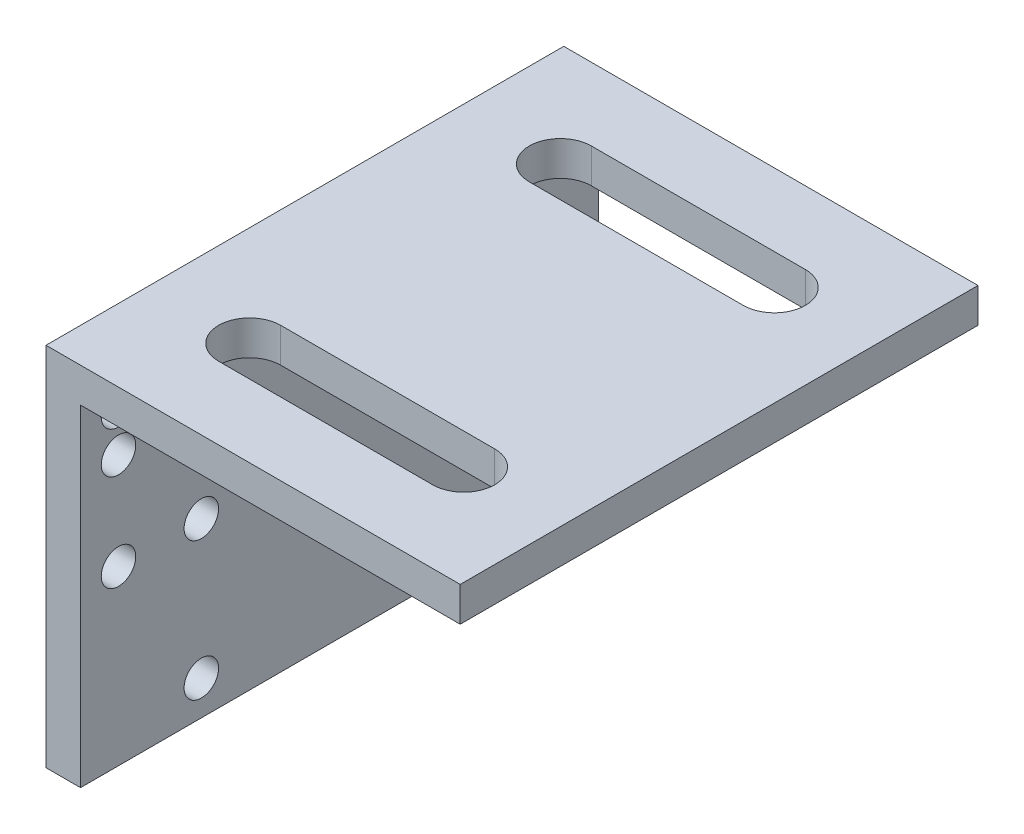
ISO-10303-21;
HEADER;
FILE_DESCRIPTION(('STEP AP214'),'2;1');
FILE_NAME('part.step','',(''),(''),'','','');
FILE_SCHEMA(('AUTOMOTIVE_DESIGN { 1 0 10303 214 1 1 1 1 }'));
ENDSEC;
DATA;
#1=APPLICATION_CONTEXT('core data for automotive mechanical design processes');
#2=APPLICATION_PROTOCOL_DEFINITION('international standard','automotive_design',2000,#1);
#3=PRODUCT_CONTEXT('',#1,'mechanical');
#4=PRODUCT('Part','Part','',(#3));
#5=PRODUCT_RELATED_PRODUCT_CATEGORY('part','',(#4));
#6=PRODUCT_DEFINITION_FORMATION('','',#4);
#7=PRODUCT_DEFINITION_CONTEXT('part definition',#1,'design');
#8=PRODUCT_DEFINITION('design','',#6,#7);
#9=PRODUCT_DEFINITION_SHAPE('','',#8);
#10=(LENGTH_UNIT() NAMED_UNIT(*) SI_UNIT(.MILLI.,.METRE.));
#11=(NAMED_UNIT(*) PLANE_ANGLE_UNIT() SI_UNIT($,.RADIAN.));
#12=(NAMED_UNIT(*) SI_UNIT($,.STERADIAN.) SOLID_ANGLE_UNIT());
#13=UNCERTAINTY_MEASURE_WITH_UNIT(LENGTH_MEASURE(1.E-05),#10,'distance_accuracy_value','');
#14=(GEOMETRIC_REPRESENTATION_CONTEXT(3) GLOBAL_UNCERTAINTY_ASSIGNED_CONTEXT((#13)) GLOBAL_UNIT_ASSIGNED_CONTEXT((#10,
#11,#12)) REPRESENTATION_CONTEXT('',''));
#15=CARTESIAN_POINT('',(0.,0.,0.));
#16=DIRECTION('',(0.,0.,1.));
#17=DIRECTION('',(1.,0.,0.));
#18=AXIS2_PLACEMENT_3D('',#15,#16,#17);
#19=CARTESIAN_POINT('',(4.99999999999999,-5.,0.));
#20=DIRECTION('',(1.,0.,0.));
#21=DIRECTION('',(0.,0.,-1.));
#22=AXIS2_PLACEMENT_3D('',#19,#20,#21);
#23=PLANE('',#22);
#24=CARTESIAN_POINT('',(4.99999999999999,-48.,-20.));
#25=DIRECTION('',(1.,0.,0.));
#26=DIRECTION('',(0.,1.,0.));
#27=AXIS2_PLACEMENT_3D('',#24,#25,#26);
#28=CIRCLE('',#27,2.5);
#29=CARTESIAN_POINT('',(4.99999999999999,-45.5,-20.));
#30=VERTEX_POINT('',#29);
#31=EDGE_CURVE('E138',#30,#30,#28,.F.);
#32=ORIENTED_EDGE('',*,*,#31,.T.);
#33=EDGE_LOOP('',(#32));
#34=FACE_BOUND('',#33,.T.);
#35=CARTESIAN_POINT('',(4.99999999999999,-28.,-20.));
#36=DIRECTION('',(1.,0.,0.));
#37=DIRECTION('',(0.,1.,0.));
#38=AXIS2_PLACEMENT_3D('',#35,#36,#37);
#39=CIRCLE('',#38,2.5);
#40=CARTESIAN_POINT('',(4.99999999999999,-25.5,-20.));
#41=VERTEX_POINT('',#40);
#42=EDGE_CURVE('E213',#41,#41,#39,.F.);
#43=ORIENTED_EDGE('',*,*,#42,.T.);
#44=EDGE_LOOP('',(#43));
#45=FACE_BOUND('',#44,.T.);
#46=CARTESIAN_POINT('',(4.99999999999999,-8.00000000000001,-20.));
#47=DIRECTION('',(1.,0.,0.));
#48=DIRECTION('',(0.,1.,0.));
#49=AXIS2_PLACEMENT_3D('',#46,#47,#48);
#50=CIRCLE('',#49,2.5);
#51=CARTESIAN_POINT('',(4.99999999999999,-5.50000000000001,-20.));
#52=VERTEX_POINT('',#51);
#53=EDGE_CURVE('E216',#52,#52,#50,.F.);
#54=ORIENTED_EDGE('',*,*,#53,.T.);
#55=EDGE_LOOP('',(#54));
#56=FACE_BOUND('',#55,.T.);
#57=CARTESIAN_POINT('',(4.99999999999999,-8.00000000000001,20.));
#58=DIRECTION('',(1.,0.,0.));
#59=DIRECTION('',(0.,1.,0.));
#60=AXIS2_PLACEMENT_3D('',#57,#58,#59);
#61=CIRCLE('',#60,2.5);
#62=CARTESIAN_POINT('',(4.99999999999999,-5.50000000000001,20.));
#63=VERTEX_POINT('',#62);
#64=EDGE_CURVE('E219',#63,#63,#61,.F.);
#65=ORIENTED_EDGE('',*,*,#64,.T.);
#66=EDGE_LOOP('',(#65));
#67=FACE_BOUND('',#66,.T.);
#68=CARTESIAN_POINT('',(4.99999999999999,-28.,20.));
#69=DIRECTION('',(1.,0.,0.));
#70=DIRECTION('',(0.,1.,0.));
#71=AXIS2_PLACEMENT_3D('',#68,#69,#70);
#72=CIRCLE('',#71,2.5);
#73=CARTESIAN_POINT('',(4.99999999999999,-25.5,20.));
#74=VERTEX_POINT('',#73);
#75=EDGE_CURVE('E222',#74,#74,#72,.F.);
#76=ORIENTED_EDGE('',*,*,#75,.T.);
#77=EDGE_LOOP('',(#76));
#78=FACE_BOUND('',#77,.T.);
#79=CARTESIAN_POINT('',(4.99999999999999,-48.,20.));
#80=DIRECTION('',(1.,0.,0.));
#81=DIRECTION('',(0.,1.,0.));
#82=AXIS2_PLACEMENT_3D('',#79,#80,#81);
#83=CIRCLE('',#82,2.5);
#84=CARTESIAN_POINT('',(4.99999999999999,-45.5,20.));
#85=VERTEX_POINT('',#84);
#86=EDGE_CURVE('E225',#85,#85,#83,.F.);
#87=ORIENTED_EDGE('',*,*,#86,.T.);
#88=EDGE_LOOP('',(#87));
#89=FACE_BOUND('',#88,.T.);
#90=CARTESIAN_POINT('',(4.99999999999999,-8.00000000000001,32.));
#91=DIRECTION('',(1.,0.,0.));
#92=DIRECTION('',(0.,1.,0.));
#93=AXIS2_PLACEMENT_3D('',#90,#91,#92);
#94=CIRCLE('',#93,2.5);
#95=CARTESIAN_POINT('',(4.99999999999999,-5.50000000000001,32.));
#96=VERTEX_POINT('',#95);
#97=EDGE_CURVE('E228',#96,#96,#94,.F.);
#98=ORIENTED_EDGE('',*,*,#97,.T.);
#99=EDGE_LOOP('',(#98));
#100=FACE_BOUND('',#99,.T.);
#101=CARTESIAN_POINT('',(4.99999999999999,-14.,32.));
#102=DIRECTION('',(1.,0.,0.));
#103=DIRECTION('',(0.,1.,0.));
#104=AXIS2_PLACEMENT_3D('',#101,#102,#103);
#105=CIRCLE('',#104,2.5);
#106=CARTESIAN_POINT('',(4.99999999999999,-11.5,32.));
#107=VERTEX_POINT('',#106);
#108=EDGE_CURVE('E230',#107,#107,#105,.F.);
#109=ORIENTED_EDGE('',*,*,#108,.T.);
#110=EDGE_LOOP('',(#109));
#111=FACE_BOUND('',#110,.T.);
#112=CARTESIAN_POINT('',(4.99999999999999,-28.,32.));
#113=DIRECTION('',(1.,0.,0.));
#114=DIRECTION('',(0.,1.,0.));
#115=AXIS2_PLACEMENT_3D('',#112,#113,#114);
#116=CIRCLE('',#115,2.5);
#117=CARTESIAN_POINT('',(4.99999999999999,-25.5,32.));
#118=VERTEX_POINT('',#117);
#119=EDGE_CURVE('E19',#118,#118,#116,.F.);
#120=ORIENTED_EDGE('',*,*,#119,.T.);
#121=EDGE_LOOP('',(#120));
#122=FACE_BOUND('',#121,.T.);
#123=DIRECTION('',(0.,1.,0.));
#124=VECTOR('',#123,1.);
#125=CARTESIAN_POINT('',(5.,-14.8185840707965,-37.5));
#126=LINE('',#125,#124);
#127=CARTESIAN_POINT('',(5.,-53.,-37.5));
#128=VERTEX_POINT('',#127);
#129=CARTESIAN_POINT('',(4.99999999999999,-4.99999999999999,-37.5));
#130=VERTEX_POINT('',#129);
#131=EDGE_CURVE('E389',#128,#130,#126,.T.);
#132=ORIENTED_EDGE('',*,*,#131,.T.);
#133=DIRECTION('',(0.,0.,-1.));
#134=VECTOR('',#133,1.);
#135=CARTESIAN_POINT('',(4.99999999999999,-4.99999999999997,0.));
#136=LINE('',#135,#134);
#137=CARTESIAN_POINT('',(4.99999999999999,-4.99999999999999,37.5));
#138=VERTEX_POINT('',#137);
#139=EDGE_CURVE('E117',#138,#130,#136,.T.);
#140=ORIENTED_EDGE('',*,*,#139,.F.);
#141=DIRECTION('',(0.,1.,0.));
#142=VECTOR('',#141,1.);
#143=CARTESIAN_POINT('',(5.,-14.8185840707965,37.5));
#144=LINE('',#143,#142);
#145=CARTESIAN_POINT('',(5.,-53.,37.5));
#146=VERTEX_POINT('',#145);
#147=EDGE_CURVE('E128',#146,#138,#144,.T.);
#148=ORIENTED_EDGE('',*,*,#147,.F.);
#149=DIRECTION('',(0.,0.,-1.));
#150=VECTOR('',#149,1.);
#151=CARTESIAN_POINT('',(5.00000000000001,-53.,0.));
#152=LINE('',#151,#150);
#153=EDGE_CURVE('E121',#128,#146,#152,.F.);
#154=ORIENTED_EDGE('',*,*,#153,.F.);
#155=EDGE_LOOP('',(#132,#140,#148,#154));
#156=FACE_BOUND('',#155,.T.);
#157=ADVANCED_FACE('F15',(#34,#45,#56,#67,#78,#89,#100,#111,#122,#156),#23,.T.);
#158=CARTESIAN_POINT('',(5.00000000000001,-53.,0.));
#159=DIRECTION('',(0.,-1.,0.));
#160=DIRECTION('',(0.,0.,-1.));
#161=AXIS2_PLACEMENT_3D('',#158,#159,#160);
#162=PLANE('',#161);
#163=DIRECTION('',(1.,0.,0.));
#164=VECTOR('',#163,1.);
#165=CARTESIAN_POINT('',(18.3185840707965,-53.,-37.5));
#166=LINE('',#165,#164);
#167=CARTESIAN_POINT('',(0.,-53.,-37.5));
#168=VERTEX_POINT('',#167);
#169=EDGE_CURVE('E93',#168,#128,#166,.T.);
#170=ORIENTED_EDGE('',*,*,#169,.T.);
#171=ORIENTED_EDGE('',*,*,#153,.T.);
#172=DIRECTION('',(1.,0.,0.));
#173=VECTOR('',#172,1.);
#174=CARTESIAN_POINT('',(18.3185840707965,-53.,37.5));
#175=LINE('',#174,#173);
#176=CARTESIAN_POINT('',(0.,-53.,37.5));
#177=VERTEX_POINT('',#176);
#178=EDGE_CURVE('E124',#177,#146,#175,.T.);
#179=ORIENTED_EDGE('',*,*,#178,.F.);
#180=DIRECTION('',(0.,0.,1.));
#181=VECTOR('',#180,1.);
#182=CARTESIAN_POINT('',(0.,-53.,0.));
#183=LINE('',#182,#181);
#184=EDGE_CURVE('E210',#168,#177,#183,.T.);
#185=ORIENTED_EDGE('',*,*,#184,.F.);
#186=EDGE_LOOP('',(#170,#171,#179,#185));
#187=FACE_BOUND('',#186,.T.);
#188=ADVANCED_FACE('F122',(#187),#162,.T.);
#189=CARTESIAN_POINT('',(0.,-28.,32.));
#190=DIRECTION('',(1.,0.,0.));
#191=DIRECTION('',(0.,1.,0.));
#192=AXIS2_PLACEMENT_3D('',#189,#190,#191);
#193=CYLINDRICAL_SURFACE('',#192,2.5);
#194=CARTESIAN_POINT('',(0.,-28.,32.));
#195=DIRECTION('',(1.,0.,0.));
#196=DIRECTION('',(0.,1.,0.));
#197=AXIS2_PLACEMENT_3D('',#194,#195,#196);
#198=CIRCLE('',#197,2.5);
#199=CARTESIAN_POINT('',(0.,-25.5,32.));
#200=VERTEX_POINT('',#199);
#201=EDGE_CURVE('E207',#200,#200,#198,.T.);
#202=ORIENTED_EDGE('',*,*,#201,.F.);
#203=EDGE_LOOP('',(#202));
#204=FACE_BOUND('',#203,.T.);
#205=ORIENTED_EDGE('',*,*,#119,.F.);
#206=EDGE_LOOP('',(#205));
#207=FACE_BOUND('',#206,.T.);
#208=ADVANCED_FACE('F238',(#204,#207),#193,.F.);
#209=CARTESIAN_POINT('',(0.,-14.,32.));
#210=DIRECTION('',(1.,0.,0.));
#211=DIRECTION('',(0.,1.,0.));
#212=AXIS2_PLACEMENT_3D('',#209,#210,#211);
#213=CYLINDRICAL_SURFACE('',#212,2.5);
#214=CARTESIAN_POINT('',(0.,-14.,32.));
#215=DIRECTION('',(1.,0.,0.));
#216=DIRECTION('',(0.,1.,0.));
#217=AXIS2_PLACEMENT_3D('',#214,#215,#216);
#218=CIRCLE('',#217,2.5);
#219=CARTESIAN_POINT('',(0.,-11.5,32.));
#220=VERTEX_POINT('',#219);
#221=EDGE_CURVE('E204',#220,#220,#218,.T.);
#222=ORIENTED_EDGE('',*,*,#221,.F.);
#223=EDGE_LOOP('',(#222));
#224=FACE_BOUND('',#223,.T.);
#225=ORIENTED_EDGE('',*,*,#108,.F.);
#226=EDGE_LOOP('',(#225));
#227=FACE_BOUND('',#226,.T.);
#228=ADVANCED_FACE('F240',(#224,#227),#213,.F.);
#229=CARTESIAN_POINT('',(0.,-8.00000000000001,32.));
#230=DIRECTION('',(1.,0.,0.));
#231=DIRECTION('',(0.,1.,0.));
#232=AXIS2_PLACEMENT_3D('',#229,#230,#231);
#233=CYLINDRICAL_SURFACE('',#232,2.5);
#234=CARTESIAN_POINT('',(0.,-8.00000000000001,32.));
#235=DIRECTION('',(1.,0.,0.));
#236=DIRECTION('',(0.,1.,0.));
#237=AXIS2_PLACEMENT_3D('',#234,#235,#236);
#238=CIRCLE('',#237,2.5);
#239=CARTESIAN_POINT('',(0.,-5.50000000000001,32.));
#240=VERTEX_POINT('',#239);
#241=EDGE_CURVE('E201',#240,#240,#238,.T.);
#242=ORIENTED_EDGE('',*,*,#241,.F.);
#243=EDGE_LOOP('',(#242));
#244=FACE_BOUND('',#243,.T.);
#245=ORIENTED_EDGE('',*,*,#97,.F.);
#246=EDGE_LOOP('',(#245));
#247=FACE_BOUND('',#246,.T.);
#248=ADVANCED_FACE('F248',(#244,#247),#233,.F.);
#249=CARTESIAN_POINT('',(0.,-48.,20.));
#250=DIRECTION('',(1.,0.,0.));
#251=DIRECTION('',(0.,1.,0.));
#252=AXIS2_PLACEMENT_3D('',#249,#250,#251);
#253=CYLINDRICAL_SURFACE('',#252,2.5);
#254=CARTESIAN_POINT('',(0.,-48.,20.));
#255=DIRECTION('',(1.,0.,0.));
#256=DIRECTION('',(0.,1.,0.));
#257=AXIS2_PLACEMENT_3D('',#254,#255,#256);
#258=CIRCLE('',#257,2.5);
#259=CARTESIAN_POINT('',(0.,-45.5,20.));
#260=VERTEX_POINT('',#259);
#261=EDGE_CURVE('E198',#260,#260,#258,.T.);
#262=ORIENTED_EDGE('',*,*,#261,.F.);
#263=EDGE_LOOP('',(#262));
#264=FACE_BOUND('',#263,.T.);
#265=ORIENTED_EDGE('',*,*,#86,.F.);
#266=EDGE_LOOP('',(#265));
#267=FACE_BOUND('',#266,.T.);
#268=ADVANCED_FACE('F328',(#264,#267),#253,.F.);
#269=CARTESIAN_POINT('',(0.,-28.,20.));
#270=DIRECTION('',(1.,0.,0.));
#271=DIRECTION('',(0.,1.,0.));
#272=AXIS2_PLACEMENT_3D('',#269,#270,#271);
#273=CYLINDRICAL_SURFACE('',#272,2.5);
#274=CARTESIAN_POINT('',(0.,-28.,20.));
#275=DIRECTION('',(1.,0.,0.));
#276=DIRECTION('',(0.,1.,0.));
#277=AXIS2_PLACEMENT_3D('',#274,#275,#276);
#278=CIRCLE('',#277,2.5);
#279=CARTESIAN_POINT('',(0.,-25.5,20.));
#280=VERTEX_POINT('',#279);
#281=EDGE_CURVE('E195',#280,#280,#278,.T.);
#282=ORIENTED_EDGE('',*,*,#281,.F.);
#283=EDGE_LOOP('',(#282));
#284=FACE_BOUND('',#283,.T.);
#285=ORIENTED_EDGE('',*,*,#75,.F.);
#286=EDGE_LOOP('',(#285));
#287=FACE_BOUND('',#286,.T.);
#288=ADVANCED_FACE('F334',(#284,#287),#273,.F.);
#289=CARTESIAN_POINT('',(0.,-8.00000000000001,20.));
#290=DIRECTION('',(1.,0.,0.));
#291=DIRECTION('',(0.,1.,0.));
#292=AXIS2_PLACEMENT_3D('',#289,#290,#291);
#293=CYLINDRICAL_SURFACE('',#292,2.5);
#294=CARTESIAN_POINT('',(0.,-8.00000000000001,20.));
#295=DIRECTION('',(1.,0.,0.));
#296=DIRECTION('',(0.,1.,0.));
#297=AXIS2_PLACEMENT_3D('',#294,#295,#296);
#298=CIRCLE('',#297,2.5);
#299=CARTESIAN_POINT('',(0.,-5.50000000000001,20.));
#300=VERTEX_POINT('',#299);
#301=EDGE_CURVE('E192',#300,#300,#298,.T.);
#302=ORIENTED_EDGE('',*,*,#301,.F.);
#303=EDGE_LOOP('',(#302));
#304=FACE_BOUND('',#303,.T.);
#305=ORIENTED_EDGE('',*,*,#64,.F.);
#306=EDGE_LOOP('',(#305));
#307=FACE_BOUND('',#306,.T.);
#308=ADVANCED_FACE('F341',(#304,#307),#293,.F.);
#309=CARTESIAN_POINT('',(0.,-8.00000000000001,-20.));
#310=DIRECTION('',(1.,0.,0.));
#311=DIRECTION('',(0.,1.,0.));
#312=AXIS2_PLACEMENT_3D('',#309,#310,#311);
#313=CYLINDRICAL_SURFACE('',#312,2.5);
#314=CARTESIAN_POINT('',(0.,-8.00000000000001,-20.));
#315=DIRECTION('',(1.,0.,0.));
#316=DIRECTION('',(0.,1.,0.));
#317=AXIS2_PLACEMENT_3D('',#314,#315,#316);
#318=CIRCLE('',#317,2.5);
#319=CARTESIAN_POINT('',(0.,-5.50000000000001,-20.));
#320=VERTEX_POINT('',#319);
#321=EDGE_CURVE('E189',#320,#320,#318,.T.);
#322=ORIENTED_EDGE('',*,*,#321,.F.);
#323=EDGE_LOOP('',(#322));
#324=FACE_BOUND('',#323,.T.);
#325=ORIENTED_EDGE('',*,*,#53,.F.);
#326=EDGE_LOOP('',(#325));
#327=FACE_BOUND('',#326,.T.);
#328=ADVANCED_FACE('F345',(#324,#327),#313,.F.);
#329=CARTESIAN_POINT('',(0.,-28.,-20.));
#330=DIRECTION('',(1.,0.,0.));
#331=DIRECTION('',(0.,1.,0.));
#332=AXIS2_PLACEMENT_3D('',#329,#330,#331);
#333=CYLINDRICAL_SURFACE('',#332,2.5);
#334=CARTESIAN_POINT('',(0.,-28.,-20.));
#335=DIRECTION('',(1.,0.,0.));
#336=DIRECTION('',(0.,1.,0.));
#337=AXIS2_PLACEMENT_3D('',#334,#335,#336);
#338=CIRCLE('',#337,2.5);
#339=CARTESIAN_POINT('',(0.,-25.5,-20.));
#340=VERTEX_POINT('',#339);
#341=EDGE_CURVE('E186',#340,#340,#338,.T.);
#342=ORIENTED_EDGE('',*,*,#341,.F.);
#343=EDGE_LOOP('',(#342));
#344=FACE_BOUND('',#343,.T.);
#345=ORIENTED_EDGE('',*,*,#42,.F.);
#346=EDGE_LOOP('',(#345));
#347=FACE_BOUND('',#346,.T.);
#348=ADVANCED_FACE('F348',(#344,#347),#333,.F.);
#349=CARTESIAN_POINT('',(0.,-48.,-20.));
#350=DIRECTION('',(1.,0.,0.));
#351=DIRECTION('',(0.,1.,0.));
#352=AXIS2_PLACEMENT_3D('',#349,#350,#351);
#353=CYLINDRICAL_SURFACE('',#352,2.5);
#354=CARTESIAN_POINT('',(0.,-48.,-20.));
#355=DIRECTION('',(1.,0.,0.));
#356=DIRECTION('',(0.,1.,0.));
#357=AXIS2_PLACEMENT_3D('',#354,#355,#356);
#358=CIRCLE('',#357,2.5);
#359=CARTESIAN_POINT('',(0.,-45.5,-20.));
#360=VERTEX_POINT('',#359);
#361=EDGE_CURVE('E183',#360,#360,#358,.T.);
#362=ORIENTED_EDGE('',*,*,#361,.F.);
#363=EDGE_LOOP('',(#362));
#364=FACE_BOUND('',#363,.T.);
#365=ORIENTED_EDGE('',*,*,#31,.F.);
#366=EDGE_LOOP('',(#365));
#367=FACE_BOUND('',#366,.T.);
#368=ADVANCED_FACE('F17',(#364,#367),#353,.F.);
#369=CARTESIAN_POINT('',(60.,-4.99999999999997,0.));
#370=DIRECTION('',(0.,-1.,0.));
#371=DIRECTION('',(0.,0.,-1.));
#372=AXIS2_PLACEMENT_3D('',#369,#370,#371);
#373=PLANE('',#372);
#374=DIRECTION('',(-1.,0.,0.));
#375=VECTOR('',#374,1.);
#376=CARTESIAN_POINT('',(45.5,-4.99999999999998,-27.));
#377=LINE('',#376,#375);
#378=CARTESIAN_POINT('',(45.5,-4.99999999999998,-27.));
#379=VERTEX_POINT('',#378);
#380=CARTESIAN_POINT('',(14.5,-4.99999999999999,-27.));
#381=VERTEX_POINT('',#380);
#382=EDGE_CURVE('E146',#379,#381,#377,.T.);
#383=ORIENTED_EDGE('',*,*,#382,.T.);
#384=CARTESIAN_POINT('',(14.5,-5.,-22.5));
#385=DIRECTION('',(0.,-1.,0.));
#386=DIRECTION('',(1.,0.,0.));
#387=AXIS2_PLACEMENT_3D('',#384,#385,#386);
#388=CIRCLE('',#387,4.5);
#389=CARTESIAN_POINT('',(14.5,-5.,-18.));
#390=VERTEX_POINT('',#389);
#391=EDGE_CURVE('E175',#381,#390,#388,.F.);
#392=ORIENTED_EDGE('',*,*,#391,.T.);
#393=DIRECTION('',(1.,0.,0.));
#394=VECTOR('',#393,1.);
#395=CARTESIAN_POINT('',(14.5,-5.,-18.));
#396=LINE('',#395,#394);
#397=CARTESIAN_POINT('',(45.5,-4.99999999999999,-18.));
#398=VERTEX_POINT('',#397);
#399=EDGE_CURVE('E142',#390,#398,#396,.T.);
#400=ORIENTED_EDGE('',*,*,#399,.T.);
#401=CARTESIAN_POINT('',(45.5,-4.99999999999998,-22.5));
#402=DIRECTION('',(0.,-1.,0.));
#403=DIRECTION('',(1.,0.,0.));
#404=AXIS2_PLACEMENT_3D('',#401,#402,#403);
#405=CIRCLE('',#404,4.5);
#406=EDGE_CURVE('E170',#398,#379,#405,.F.);
#407=ORIENTED_EDGE('',*,*,#406,.T.);
#408=EDGE_LOOP('',(#383,#392,#400,#407));
#409=FACE_BOUND('',#408,.T.);
#410=CARTESIAN_POINT('',(14.5,-5.,22.5));
#411=DIRECTION('',(0.,-1.,0.));
#412=DIRECTION('',(1.,0.,0.));
#413=AXIS2_PLACEMENT_3D('',#410,#411,#412);
#414=CIRCLE('',#413,4.5);
#415=CARTESIAN_POINT('',(14.5,-4.99999999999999,18.));
#416=VERTEX_POINT('',#415);
#417=CARTESIAN_POINT('',(14.5,-5.,27.));
#418=VERTEX_POINT('',#417);
#419=EDGE_CURVE('E178',#416,#418,#414,.F.);
#420=ORIENTED_EDGE('',*,*,#419,.T.);
#421=DIRECTION('',(1.,0.,0.));
#422=VECTOR('',#421,1.);
#423=CARTESIAN_POINT('',(14.5,-5.,27.));
#424=LINE('',#423,#422);
#425=CARTESIAN_POINT('',(45.5,-4.99999999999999,27.));
#426=VERTEX_POINT('',#425);
#427=EDGE_CURVE('E153',#418,#426,#424,.T.);
#428=ORIENTED_EDGE('',*,*,#427,.T.);
#429=CARTESIAN_POINT('',(45.5,-4.99999999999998,22.5));
#430=DIRECTION('',(0.,-1.,0.));
#431=DIRECTION('',(1.,0.,0.));
#432=AXIS2_PLACEMENT_3D('',#429,#430,#431);
#433=CIRCLE('',#432,4.5);
#434=CARTESIAN_POINT('',(45.5,-4.99999999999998,18.));
#435=VERTEX_POINT('',#434);
#436=EDGE_CURVE('E84',#426,#435,#433,.F.);
#437=ORIENTED_EDGE('',*,*,#436,.T.);
#438=DIRECTION('',(-1.,0.,0.));
#439=VECTOR('',#438,1.);
#440=CARTESIAN_POINT('',(45.5,-4.99999999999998,18.));
#441=LINE('',#440,#439);
#442=EDGE_CURVE('E145',#435,#416,#441,.T.);
#443=ORIENTED_EDGE('',*,*,#442,.T.);
#444=EDGE_LOOP('',(#420,#428,#437,#443));
#445=FACE_BOUND('',#444,.T.);
#446=DIRECTION('',(1.,0.,0.));
#447=VECTOR('',#446,1.);
#448=CARTESIAN_POINT('',(18.3185840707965,-5.,-37.5));
#449=LINE('',#448,#447);
#450=CARTESIAN_POINT('',(60.,-4.99999999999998,-37.5));
#451=VERTEX_POINT('',#450);
#452=EDGE_CURVE('E387',#130,#451,#449,.T.);
#453=ORIENTED_EDGE('',*,*,#452,.T.);
#454=DIRECTION('',(0.,0.,-1.));
#455=VECTOR('',#454,1.);
#456=CARTESIAN_POINT('',(60.,-4.99999999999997,0.));
#457=LINE('',#456,#455);
#458=CARTESIAN_POINT('',(60.,-4.99999999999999,37.5));
#459=VERTEX_POINT('',#458);
#460=EDGE_CURVE('E391',#459,#451,#457,.T.);
#461=ORIENTED_EDGE('',*,*,#460,.F.);
#462=DIRECTION('',(1.,0.,0.));
#463=VECTOR('',#462,1.);
#464=CARTESIAN_POINT('',(18.3185840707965,-5.,37.5));
#465=LINE('',#464,#463);
#466=EDGE_CURVE('E130',#138,#459,#465,.T.);
#467=ORIENTED_EDGE('',*,*,#466,.F.);
#468=ORIENTED_EDGE('',*,*,#139,.T.);
#469=EDGE_LOOP('',(#453,#461,#467,#468));
#470=FACE_BOUND('',#469,.T.);
#471=ADVANCED_FACE('F306',(#409,#445,#470),#373,.T.);
#472=CARTESIAN_POINT('',(18.3185840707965,-14.8185840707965,37.5));
#473=DIRECTION('',(0.,0.,1.));
#474=DIRECTION('',(1.,0.,0.));
#475=AXIS2_PLACEMENT_3D('',#472,#473,#474);
#476=PLANE('',#475);
#477=ORIENTED_EDGE('',*,*,#466,.T.);
#478=DIRECTION('',(0.,1.,0.));
#479=VECTOR('',#478,1.);
#480=CARTESIAN_POINT('',(60.,0.,37.5));
#481=LINE('',#480,#479);
#482=CARTESIAN_POINT('',(60.,0.,37.5));
#483=VERTEX_POINT('',#482);
#484=EDGE_CURVE('E394',#483,#459,#481,.F.);
#485=ORIENTED_EDGE('',*,*,#484,.F.);
#486=DIRECTION('',(1.,0.,0.));
#487=VECTOR('',#486,1.);
#488=CARTESIAN_POINT('',(0.,0.,37.5));
#489=LINE('',#488,#487);
#490=CARTESIAN_POINT('',(0.,0.,37.5));
#491=VERTEX_POINT('',#490);
#492=EDGE_CURVE('E173',#491,#483,#489,.T.);
#493=ORIENTED_EDGE('',*,*,#492,.F.);
#494=DIRECTION('',(0.,1.,0.));
#495=VECTOR('',#494,1.);
#496=CARTESIAN_POINT('',(0.,-53.,37.5));
#497=LINE('',#496,#495);
#498=EDGE_CURVE('E135',#177,#491,#497,.T.);
#499=ORIENTED_EDGE('',*,*,#498,.F.);
#500=ORIENTED_EDGE('',*,*,#178,.T.);
#501=ORIENTED_EDGE('',*,*,#147,.T.);
#502=EDGE_LOOP('',(#477,#485,#493,#499,#500,#501));
#503=FACE_BOUND('',#502,.T.);
#504=ADVANCED_FACE('F132',(#503),#476,.T.);
#505=CARTESIAN_POINT('',(60.,0.,0.));
#506=DIRECTION('',(1.,0.,0.));
#507=DIRECTION('',(0.,0.,-1.));
#508=AXIS2_PLACEMENT_3D('',#505,#506,#507);
#509=PLANE('',#508);
#510=DIRECTION('',(0.,1.,0.));
#511=VECTOR('',#510,1.);
#512=CARTESIAN_POINT('',(60.,-14.8185840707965,-37.5));
#513=LINE('',#512,#511);
#514=CARTESIAN_POINT('',(60.,0.,-37.5));
#515=VERTEX_POINT('',#514);
#516=EDGE_CURVE('E384',#451,#515,#513,.T.);
#517=ORIENTED_EDGE('',*,*,#516,.T.);
#518=DIRECTION('',(0.,0.,1.));
#519=VECTOR('',#518,1.);
#520=CARTESIAN_POINT('',(60.,0.,0.));
#521=LINE('',#520,#519);
#522=EDGE_CURVE('E403',#483,#515,#521,.F.);
#523=ORIENTED_EDGE('',*,*,#522,.F.);
#524=ORIENTED_EDGE('',*,*,#484,.T.);
#525=ORIENTED_EDGE('',*,*,#460,.T.);
#526=EDGE_LOOP('',(#517,#523,#524,#525));
#527=FACE_BOUND('',#526,.T.);
#528=ADVANCED_FACE('F300',(#527),#509,.T.);
#529=CARTESIAN_POINT('',(18.3185840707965,-14.8185840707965,-37.5));
#530=DIRECTION('',(0.,0.,1.));
#531=DIRECTION('',(1.,0.,0.));
#532=AXIS2_PLACEMENT_3D('',#529,#530,#531);
#533=PLANE('',#532);
#534=DIRECTION('',(0.,1.,0.));
#535=VECTOR('',#534,1.);
#536=CARTESIAN_POINT('',(0.,-53.,-37.5));
#537=LINE('',#536,#535);
#538=CARTESIAN_POINT('',(0.,0.,-37.5));
#539=VERTEX_POINT('',#538);
#540=EDGE_CURVE('E374',#539,#168,#537,.F.);
#541=ORIENTED_EDGE('',*,*,#540,.F.);
#542=DIRECTION('',(1.,0.,0.));
#543=VECTOR('',#542,1.);
#544=CARTESIAN_POINT('',(0.,0.,-37.5));
#545=LINE('',#544,#543);
#546=EDGE_CURVE('E407',#515,#539,#545,.F.);
#547=ORIENTED_EDGE('',*,*,#546,.F.);
#548=ORIENTED_EDGE('',*,*,#516,.F.);
#549=ORIENTED_EDGE('',*,*,#452,.F.);
#550=ORIENTED_EDGE('',*,*,#131,.F.);
#551=ORIENTED_EDGE('',*,*,#169,.F.);
#552=EDGE_LOOP('',(#541,#547,#548,#549,#550,#551));
#553=FACE_BOUND('',#552,.T.);
#554=ADVANCED_FACE('F296',(#553),#533,.F.);
#555=CARTESIAN_POINT('',(0.,-53.,0.));
#556=DIRECTION('',(-1.,0.,0.));
#557=DIRECTION('',(0.,0.,1.));
#558=AXIS2_PLACEMENT_3D('',#555,#556,#557);
#559=PLANE('',#558);
#560=ORIENTED_EDGE('',*,*,#361,.T.);
#561=EDGE_LOOP('',(#560));
#562=FACE_BOUND('',#561,.T.);
#563=ORIENTED_EDGE('',*,*,#341,.T.);
#564=EDGE_LOOP('',(#563));
#565=FACE_BOUND('',#564,.T.);
#566=ORIENTED_EDGE('',*,*,#321,.T.);
#567=EDGE_LOOP('',(#566));
#568=FACE_BOUND('',#567,.T.);
#569=ORIENTED_EDGE('',*,*,#301,.T.);
#570=EDGE_LOOP('',(#569));
#571=FACE_BOUND('',#570,.T.);
#572=ORIENTED_EDGE('',*,*,#281,.T.);
#573=EDGE_LOOP('',(#572));
#574=FACE_BOUND('',#573,.T.);
#575=ORIENTED_EDGE('',*,*,#261,.T.);
#576=EDGE_LOOP('',(#575));
#577=FACE_BOUND('',#576,.T.);
#578=ORIENTED_EDGE('',*,*,#241,.T.);
#579=EDGE_LOOP('',(#578));
#580=FACE_BOUND('',#579,.T.);
#581=ORIENTED_EDGE('',*,*,#221,.T.);
#582=EDGE_LOOP('',(#581));
#583=FACE_BOUND('',#582,.T.);
#584=ORIENTED_EDGE('',*,*,#201,.T.);
#585=EDGE_LOOP('',(#584));
#586=FACE_BOUND('',#585,.T.);
#587=ORIENTED_EDGE('',*,*,#540,.T.);
#588=ORIENTED_EDGE('',*,*,#184,.T.);
#589=ORIENTED_EDGE('',*,*,#498,.T.);
#590=DIRECTION('',(0.,0.,1.));
#591=VECTOR('',#590,1.);
#592=CARTESIAN_POINT('',(0.,0.,0.));
#593=LINE('',#592,#591);
#594=EDGE_CURVE('E169',#539,#491,#593,.T.);
#595=ORIENTED_EDGE('',*,*,#594,.F.);
#596=EDGE_LOOP('',(#587,#588,#589,#595));
#597=FACE_BOUND('',#596,.T.);
#598=ADVANCED_FACE('F293',(#562,#565,#568,#571,#574,#577,#580,#583,#586,#597),#559,.T.);
#599=CARTESIAN_POINT('',(45.5,0.,22.5));
#600=DIRECTION('',(0.,-1.,0.));
#601=DIRECTION('',(1.,0.,0.));
#602=AXIS2_PLACEMENT_3D('',#599,#600,#601);
#603=CYLINDRICAL_SURFACE('',#602,4.5);
#604=DIRECTION('',(0.,1.,0.));
#605=VECTOR('',#604,1.);
#606=CARTESIAN_POINT('',(45.5,0.,27.));
#607=LINE('',#606,#605);
#608=CARTESIAN_POINT('',(45.5,0.,27.));
#609=VERTEX_POINT('',#608);
#610=EDGE_CURVE('E155',#426,#609,#607,.T.);
#611=ORIENTED_EDGE('',*,*,#610,.T.);
#612=CARTESIAN_POINT('',(45.5,0.,22.5));
#613=DIRECTION('',(0.,-1.,0.));
#614=DIRECTION('',(1.,0.,0.));
#615=AXIS2_PLACEMENT_3D('',#612,#613,#614);
#616=CIRCLE('',#615,4.5);
#617=CARTESIAN_POINT('',(45.5,0.,18.));
#618=VERTEX_POINT('',#617);
#619=EDGE_CURVE('E166',#618,#609,#616,.T.);
#620=ORIENTED_EDGE('',*,*,#619,.F.);
#621=DIRECTION('',(0.,1.,0.));
#622=VECTOR('',#621,1.);
#623=CARTESIAN_POINT('',(45.5,0.,18.));
#624=LINE('',#623,#622);
#625=EDGE_CURVE('E152',#618,#435,#624,.F.);
#626=ORIENTED_EDGE('',*,*,#625,.T.);
#627=ORIENTED_EDGE('',*,*,#436,.F.);
#628=EDGE_LOOP('',(#611,#620,#626,#627));
#629=FACE_BOUND('',#628,.T.);
#630=ADVANCED_FACE('F289',(#629),#603,.F.);
#631=CARTESIAN_POINT('',(14.5,0.,27.));
#632=DIRECTION('',(0.,0.,1.));
#633=DIRECTION('',(1.,0.,0.));
#634=AXIS2_PLACEMENT_3D('',#631,#632,#633);
#635=PLANE('',#634);
#636=DIRECTION('',(0.,-1.,0.));
#637=VECTOR('',#636,1.);
#638=CARTESIAN_POINT('',(14.5,0.,27.));
#639=LINE('',#638,#637);
#640=CARTESIAN_POINT('',(14.5,0.,27.));
#641=VERTEX_POINT('',#640);
#642=EDGE_CURVE('E154',#418,#641,#639,.F.);
#643=ORIENTED_EDGE('',*,*,#642,.T.);
#644=DIRECTION('',(1.,0.,0.));
#645=VECTOR('',#644,1.);
#646=CARTESIAN_POINT('',(0.,0.,27.));
#647=LINE('',#646,#645);
#648=EDGE_CURVE('E165',#609,#641,#647,.F.);
#649=ORIENTED_EDGE('',*,*,#648,.F.);
#650=ORIENTED_EDGE('',*,*,#610,.F.);
#651=ORIENTED_EDGE('',*,*,#427,.F.);
#652=EDGE_LOOP('',(#643,#649,#650,#651));
#653=FACE_BOUND('',#652,.T.);
#654=ADVANCED_FACE('F285',(#653),#635,.F.);
#655=CARTESIAN_POINT('',(14.5,0.,22.5));
#656=DIRECTION('',(0.,-1.,0.));
#657=DIRECTION('',(1.,0.,0.));
#658=AXIS2_PLACEMENT_3D('',#655,#656,#657);
#659=CYLINDRICAL_SURFACE('',#658,4.5);
#660=DIRECTION('',(0.,1.,0.));
#661=VECTOR('',#660,1.);
#662=CARTESIAN_POINT('',(14.5,0.,18.));
#663=LINE('',#662,#661);
#664=CARTESIAN_POINT('',(14.5,0.,18.));
#665=VERTEX_POINT('',#664);
#666=EDGE_CURVE('E181',#416,#665,#663,.T.);
#667=ORIENTED_EDGE('',*,*,#666,.T.);
#668=CARTESIAN_POINT('',(14.5,0.,22.5));
#669=DIRECTION('',(0.,-1.,0.));
#670=DIRECTION('',(1.,0.,0.));
#671=AXIS2_PLACEMENT_3D('',#668,#669,#670);
#672=CIRCLE('',#671,4.5);
#673=EDGE_CURVE('E161',#641,#665,#672,.T.);
#674=ORIENTED_EDGE('',*,*,#673,.F.);
#675=ORIENTED_EDGE('',*,*,#642,.F.);
#676=ORIENTED_EDGE('',*,*,#419,.F.);
#677=EDGE_LOOP('',(#667,#674,#675,#676));
#678=FACE_BOUND('',#677,.T.);
#679=ADVANCED_FACE('F281',(#678),#659,.F.);
#680=CARTESIAN_POINT('',(45.5,0.,18.));
#681=DIRECTION('',(0.,0.,-1.));
#682=DIRECTION('',(-1.,0.,0.));
#683=AXIS2_PLACEMENT_3D('',#680,#681,#682);
#684=PLANE('',#683);
#685=ORIENTED_EDGE('',*,*,#625,.F.);
#686=DIRECTION('',(1.,0.,0.));
#687=VECTOR('',#686,1.);
#688=CARTESIAN_POINT('',(0.,0.,18.));
#689=LINE('',#688,#687);
#690=EDGE_CURVE('E164',#665,#618,#689,.T.);
#691=ORIENTED_EDGE('',*,*,#690,.F.);
#692=ORIENTED_EDGE('',*,*,#666,.F.);
#693=ORIENTED_EDGE('',*,*,#442,.F.);
#694=EDGE_LOOP('',(#685,#691,#692,#693));
#695=FACE_BOUND('',#694,.T.);
#696=ADVANCED_FACE('F277',(#695),#684,.F.);
#697=CARTESIAN_POINT('',(14.5,0.,-18.));
#698=DIRECTION('',(0.,0.,1.));
#699=DIRECTION('',(1.,0.,0.));
#700=AXIS2_PLACEMENT_3D('',#697,#698,#699);
#701=PLANE('',#700);
#702=DIRECTION('',(0.,-1.,0.));
#703=VECTOR('',#702,1.);
#704=CARTESIAN_POINT('',(14.5,0.,-18.));
#705=LINE('',#704,#703);
#706=CARTESIAN_POINT('',(14.5,0.,-18.));
#707=VERTEX_POINT('',#706);
#708=EDGE_CURVE('E144',#390,#707,#705,.F.);
#709=ORIENTED_EDGE('',*,*,#708,.T.);
#710=DIRECTION('',(1.,0.,0.));
#711=VECTOR('',#710,1.);
#712=CARTESIAN_POINT('',(0.,0.,-18.));
#713=LINE('',#712,#711);
#714=CARTESIAN_POINT('',(45.5,0.,-18.));
#715=VERTEX_POINT('',#714);
#716=EDGE_CURVE('E160',#715,#707,#713,.F.);
#717=ORIENTED_EDGE('',*,*,#716,.F.);
#718=DIRECTION('',(0.,-1.,0.));
#719=VECTOR('',#718,1.);
#720=CARTESIAN_POINT('',(45.5,0.,-18.));
#721=LINE('',#720,#719);
#722=EDGE_CURVE('E174',#715,#398,#721,.T.);
#723=ORIENTED_EDGE('',*,*,#722,.T.);
#724=ORIENTED_EDGE('',*,*,#399,.F.);
#725=EDGE_LOOP('',(#709,#717,#723,#724));
#726=FACE_BOUND('',#725,.T.);
#727=ADVANCED_FACE('F273',(#726),#701,.F.);
#728=CARTESIAN_POINT('',(14.5,0.,-22.5));
#729=DIRECTION('',(0.,-1.,0.));
#730=DIRECTION('',(1.,0.,0.));
#731=AXIS2_PLACEMENT_3D('',#728,#729,#730);
#732=CYLINDRICAL_SURFACE('',#731,4.5);
#733=DIRECTION('',(0.,1.,0.));
#734=VECTOR('',#733,1.);
#735=CARTESIAN_POINT('',(14.5,0.,-27.));
#736=LINE('',#735,#734);
#737=CARTESIAN_POINT('',(14.5,0.,-27.));
#738=VERTEX_POINT('',#737);
#739=EDGE_CURVE('E149',#381,#738,#736,.T.);
#740=ORIENTED_EDGE('',*,*,#739,.T.);
#741=CARTESIAN_POINT('',(14.5,0.,-22.5));
#742=DIRECTION('',(0.,-1.,0.));
#743=DIRECTION('',(1.,0.,0.));
#744=AXIS2_PLACEMENT_3D('',#741,#742,#743);
#745=CIRCLE('',#744,4.5);
#746=EDGE_CURVE('E157',#707,#738,#745,.T.);
#747=ORIENTED_EDGE('',*,*,#746,.F.);
#748=ORIENTED_EDGE('',*,*,#708,.F.);
#749=ORIENTED_EDGE('',*,*,#391,.F.);
#750=EDGE_LOOP('',(#740,#747,#748,#749));
#751=FACE_BOUND('',#750,.T.);
#752=ADVANCED_FACE('F270',(#751),#732,.F.);
#753=CARTESIAN_POINT('',(45.5,0.,-27.));
#754=DIRECTION('',(0.,0.,-1.));
#755=DIRECTION('',(-1.,0.,0.));
#756=AXIS2_PLACEMENT_3D('',#753,#754,#755);
#757=PLANE('',#756);
#758=DIRECTION('',(0.,-1.,0.));
#759=VECTOR('',#758,1.);
#760=CARTESIAN_POINT('',(45.5,0.,-27.));
#761=LINE('',#760,#759);
#762=CARTESIAN_POINT('',(45.5,0.,-27.));
#763=VERTEX_POINT('',#762);
#764=EDGE_CURVE('E34',#379,#763,#761,.F.);
#765=ORIENTED_EDGE('',*,*,#764,.T.);
#766=DIRECTION('',(1.,0.,0.));
#767=VECTOR('',#766,1.);
#768=CARTESIAN_POINT('',(0.,0.,-27.));
#769=LINE('',#768,#767);
#770=EDGE_CURVE('E25',#738,#763,#769,.T.);
#771=ORIENTED_EDGE('',*,*,#770,.F.);
#772=ORIENTED_EDGE('',*,*,#739,.F.);
#773=ORIENTED_EDGE('',*,*,#382,.F.);
#774=EDGE_LOOP('',(#765,#771,#772,#773));
#775=FACE_BOUND('',#774,.T.);
#776=ADVANCED_FACE('F262',(#775),#757,.F.);
#777=CARTESIAN_POINT('',(45.5,0.,-22.5));
#778=DIRECTION('',(0.,-1.,0.));
#779=DIRECTION('',(1.,0.,0.));
#780=AXIS2_PLACEMENT_3D('',#777,#778,#779);
#781=CYLINDRICAL_SURFACE('',#780,4.5);
#782=ORIENTED_EDGE('',*,*,#722,.F.);
#783=CARTESIAN_POINT('',(45.5,0.,-22.5));
#784=DIRECTION('',(0.,-1.,0.));
#785=DIRECTION('',(1.,0.,0.));
#786=AXIS2_PLACEMENT_3D('',#783,#784,#785);
#787=CIRCLE('',#786,4.5);
#788=EDGE_CURVE('E10',#763,#715,#787,.T.);
#789=ORIENTED_EDGE('',*,*,#788,.F.);
#790=ORIENTED_EDGE('',*,*,#764,.F.);
#791=ORIENTED_EDGE('',*,*,#406,.F.);
#792=EDGE_LOOP('',(#782,#789,#790,#791));
#793=FACE_BOUND('',#792,.T.);
#794=ADVANCED_FACE('F256',(#793),#781,.F.);
#795=CARTESIAN_POINT('',(0.,0.,0.));
#796=DIRECTION('',(0.,1.,0.));
#797=DIRECTION('',(0.,0.,1.));
#798=AXIS2_PLACEMENT_3D('',#795,#796,#797);
#799=PLANE('',#798);
#800=ORIENTED_EDGE('',*,*,#770,.T.);
#801=ORIENTED_EDGE('',*,*,#788,.T.);
#802=ORIENTED_EDGE('',*,*,#716,.T.);
#803=ORIENTED_EDGE('',*,*,#746,.T.);
#804=EDGE_LOOP('',(#800,#801,#802,#803));
#805=FACE_BOUND('',#804,.T.);
#806=ORIENTED_EDGE('',*,*,#673,.T.);
#807=ORIENTED_EDGE('',*,*,#690,.T.);
#808=ORIENTED_EDGE('',*,*,#619,.T.);
#809=ORIENTED_EDGE('',*,*,#648,.T.);
#810=EDGE_LOOP('',(#806,#807,#808,#809));
#811=FACE_BOUND('',#810,.T.);
#812=ORIENTED_EDGE('',*,*,#546,.T.);
#813=ORIENTED_EDGE('',*,*,#594,.T.);
#814=ORIENTED_EDGE('',*,*,#492,.T.);
#815=ORIENTED_EDGE('',*,*,#522,.T.);
#816=EDGE_LOOP('',(#812,#813,#814,#815));
#817=FACE_BOUND('',#816,.T.);
#818=ADVANCED_FACE('F254',(#805,#811,#817),#799,.T.);
#819=CLOSED_SHELL('',(#157,#188,#208,#228,#248,#268,#288,#308,#328,#348,#368,#471,#504,#528,
#554,#598,#630,#654,#679,#696,#727,#752,#776,#794,#818));
#820=MANIFOLD_SOLID_BREP('B1',#819);
#821=ADVANCED_BREP_SHAPE_REPRESENTATION('',(#18,#820),#14);
#822=SHAPE_DEFINITION_REPRESENTATION(#9,#821);
ENDSEC;
END-ISO-10303-21;
